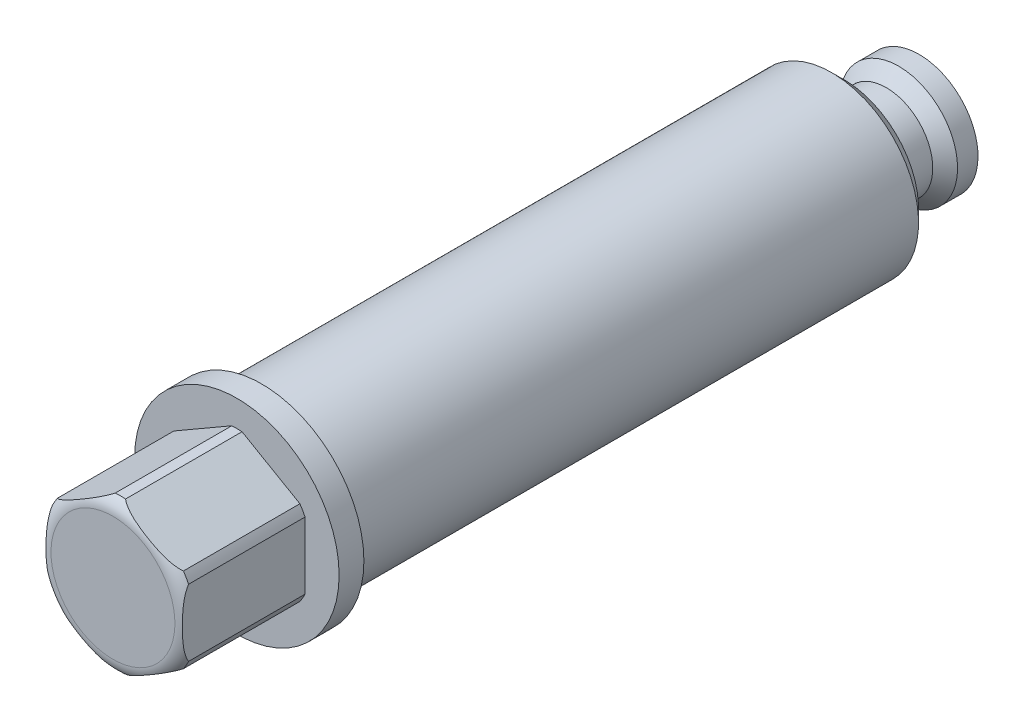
ISO-10303-21;
HEADER;
FILE_DESCRIPTION(('STEP AP214'),'2;1');
FILE_NAME('part.step','',(''),(''),'','','');
FILE_SCHEMA(('AUTOMOTIVE_DESIGN { 1 0 10303 214 1 1 1 1 }'));
ENDSEC;
DATA;
#1=APPLICATION_CONTEXT('core data for automotive mechanical design processes');
#2=APPLICATION_PROTOCOL_DEFINITION('international standard','automotive_design',2000,#1);
#3=PRODUCT_CONTEXT('',#1,'mechanical');
#4=PRODUCT('Part','Part','',(#3));
#5=PRODUCT_RELATED_PRODUCT_CATEGORY('part','',(#4));
#6=PRODUCT_DEFINITION_FORMATION('','',#4);
#7=PRODUCT_DEFINITION_CONTEXT('part definition',#1,'design');
#8=PRODUCT_DEFINITION('design','',#6,#7);
#9=PRODUCT_DEFINITION_SHAPE('','',#8);
#10=(LENGTH_UNIT() NAMED_UNIT(*) SI_UNIT(.MILLI.,.METRE.));
#11=(NAMED_UNIT(*) PLANE_ANGLE_UNIT() SI_UNIT($,.RADIAN.));
#12=(NAMED_UNIT(*) SI_UNIT($,.STERADIAN.) SOLID_ANGLE_UNIT());
#13=UNCERTAINTY_MEASURE_WITH_UNIT(LENGTH_MEASURE(1.E-05),#10,'distance_accuracy_value','');
#14=(GEOMETRIC_REPRESENTATION_CONTEXT(3) GLOBAL_UNCERTAINTY_ASSIGNED_CONTEXT((#13)) GLOBAL_UNIT_ASSIGNED_CONTEXT((#10,
#11,#12)) REPRESENTATION_CONTEXT('',''));
#15=CARTESIAN_POINT('',(0.,0.,0.));
#16=DIRECTION('',(0.,0.,1.));
#17=DIRECTION('',(1.,0.,0.));
#18=AXIS2_PLACEMENT_3D('',#15,#16,#17);
#19=CARTESIAN_POINT('',(0.,-12.7017059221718,113.));
#20=DIRECTION('',(0.5,-0.866025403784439,0.));
#21=DIRECTION('',(0.866025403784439,0.5,0.));
#22=AXIS2_PLACEMENT_3D('',#19,#20,#21);
#23=PLANE('',#22);
#24=CARTESIAN_POINT('',(10.1687123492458,-6.83079711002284,131.793859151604));
#25=CARTESIAN_POINT('',(10.1129325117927,-6.8630016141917,131.836482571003));
#26=CARTESIAN_POINT('',(10.0559059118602,-6.89592593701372,131.876855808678));
#27=CARTESIAN_POINT('',(9.93996765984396,-6.96286291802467,131.953381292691));
#28=CARTESIAN_POINT('',(9.88106158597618,-6.99687235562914,131.989544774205));
#29=CARTESIAN_POINT('',(9.76170288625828,-7.06578413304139,132.05813598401));
#30=CARTESIAN_POINT('',(9.70125131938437,-7.10068586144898,132.090566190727));
#31=CARTESIAN_POINT('',(9.58016618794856,-7.1705943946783,132.151521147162));
#32=CARTESIAN_POINT('',(9.51955479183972,-7.20558840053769,132.180104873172));
#33=CARTESIAN_POINT('',(9.39732105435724,-7.27616008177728,132.234347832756));
#34=CARTESIAN_POINT('',(9.33569812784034,-7.3117380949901,132.260005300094));
#35=CARTESIAN_POINT('',(9.21165950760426,-7.38335182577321,132.30865335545));
#36=CARTESIAN_POINT('',(9.14924366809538,-7.41938762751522,132.331643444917));
#37=CARTESIAN_POINT('',(8.99138382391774,-7.51052805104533,132.386452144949));
#38=CARTESIAN_POINT('',(8.89552952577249,-7.56586955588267,132.416698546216));
#39=CARTESIAN_POINT('',(8.70277268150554,-7.67715777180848,132.472386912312));
#40=CARTESIAN_POINT('',(8.60586989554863,-7.73310462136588,132.497827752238));
#41=CARTESIAN_POINT('',(8.31379127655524,-7.90173629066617,132.568003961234));
#42=CARTESIAN_POINT('',(8.1174903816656,-8.01507066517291,132.606511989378));
#43=CARTESIAN_POINT('',(7.72323299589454,-8.24269527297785,132.671143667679));
#44=CARTESIAN_POINT('',(7.52527491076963,-8.35698642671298,132.697253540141));
#45=CARTESIAN_POINT('',(7.12360101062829,-8.58889296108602,132.740582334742));
#46=CARTESIAN_POINT('',(6.91986619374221,-8.7065193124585,132.757559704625));
#47=CARTESIAN_POINT('',(6.51231016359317,-8.9418218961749,132.783809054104));
#48=CARTESIAN_POINT('',(6.30848940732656,-9.05949786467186,132.793091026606));
#49=CARTESIAN_POINT('',(5.90086638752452,-9.29483912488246,132.805276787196));
#50=CARTESIAN_POINT('',(5.69706422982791,-9.41250435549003,132.808185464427));
#51=CARTESIAN_POINT('',(5.31834568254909,-9.63115761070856,132.80805760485));
#52=CARTESIAN_POINT('',(5.14342867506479,-9.73214599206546,132.805805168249));
#53=CARTESIAN_POINT('',(4.79363062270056,-9.93410199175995,132.796664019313));
#54=CARTESIAN_POINT('',(4.6187496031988,-10.0350695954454,132.789773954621));
#55=CARTESIAN_POINT('',(4.2689614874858,-10.2370198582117,132.770635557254));
#56=CARTESIAN_POINT('',(4.09405468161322,-10.3380023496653,132.758379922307));
#57=CARTESIAN_POINT('',(3.74416838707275,-10.540009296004,132.727259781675));
#58=CARTESIAN_POINT('',(3.5691900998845,-10.6410330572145,132.708376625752));
#59=CARTESIAN_POINT('',(3.22483803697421,-10.8398448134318,132.662887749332));
#60=CARTESIAN_POINT('',(3.05544239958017,-10.9376454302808,132.636508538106));
#61=CARTESIAN_POINT('',(2.71815589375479,-11.132377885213,132.57369473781));
#62=CARTESIAN_POINT('',(2.55026388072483,-11.2293103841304,132.53726861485));
#63=CARTESIAN_POINT('',(2.21755075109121,-11.4214023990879,132.451677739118));
#64=CARTESIAN_POINT('',(2.05272044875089,-11.5165672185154,132.402561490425));
#65=CARTESIAN_POINT('',(1.72770212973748,-11.7042166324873,132.28800126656));
#66=CARTESIAN_POINT('',(1.56750164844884,-11.7967084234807,132.222606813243));
#67=CARTESIAN_POINT('',(1.36101704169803,-11.9159223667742,132.122343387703));
#68=CARTESIAN_POINT('',(1.31126364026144,-11.9446475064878,132.09690891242));
#69=CARTESIAN_POINT('',(1.21270295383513,-12.0015515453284,132.043669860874));
#70=CARTESIAN_POINT('',(1.1638958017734,-12.0297303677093,132.015864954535));
#71=CARTESIAN_POINT('',(1.06692575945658,-12.085716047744,131.957391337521));
#72=CARTESIAN_POINT('',(1.01877501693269,-12.1135158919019,131.926695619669));
#73=CARTESIAN_POINT('',(0.923894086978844,-12.1682954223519,131.862461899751));
#74=CARTESIAN_POINT('',(0.877164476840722,-12.1952747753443,131.828922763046));
#75=CARTESIAN_POINT('',(0.831287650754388,-12.2217617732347,131.793859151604));
#76=B_SPLINE_CURVE_WITH_KNOTS('',3,(#24,#25,#26,#27,#28,#29,#30,#31,#32,#33,#34,#35,#36,#37,#38,
#39,#40,#41,#42,#43,#44,#45,#46,#47,#48,#49,#50,#51,#52,#53,#54,#55,#56,#57,#58,#59,#60,#61,#62,
#63,#64,#65,#66,#67,#68,#69,#70,#71,#72,#73,#74,#75),.UNSPECIFIED.,.F.,.F.,(4,2,2,2,2,2,2,2,2,2,
2,2,2,2,2,2,2,2,2,2,2,2,2,2,2,4),(0.,0.231599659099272,0.462566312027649,0.693378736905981,
0.920104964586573,1.14696732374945,1.3738720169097,1.71795811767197,2.06212466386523,
2.75133882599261,3.44131710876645,4.1487449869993,4.85525278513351,5.56121841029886,
6.16713955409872,6.77323746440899,7.38016282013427,7.98880997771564,8.58072917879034,
9.17215111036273,9.76134512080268,10.3487681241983,10.5372122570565,10.7256826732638,
10.9161322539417,11.1066581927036),.UNSPECIFIED.);
#77=CARTESIAN_POINT('',(10.1687123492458,-6.83079711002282,131.793859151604));
#78=VERTEX_POINT('',#77);
#79=CARTESIAN_POINT('',(0.831287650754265,-12.2217617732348,131.793859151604));
#80=VERTEX_POINT('',#79);
#81=EDGE_CURVE('E172',#78,#80,#76,.T.);
#82=ORIENTED_EDGE('',*,*,#81,.T.);
#83=DIRECTION('',(0.,0.,1.));
#84=VECTOR('',#83,1.);
#85=CARTESIAN_POINT('',(0.831287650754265,-12.2217617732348,113.));
#86=LINE('',#85,#84);
#87=CARTESIAN_POINT('',(0.831287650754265,-12.2217617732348,113.));
#88=VERTEX_POINT('',#87);
#89=EDGE_CURVE('E161',#88,#80,#86,.T.);
#90=ORIENTED_EDGE('',*,*,#89,.F.);
#91=DIRECTION('',(-0.866025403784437,-0.5,0.));
#92=VECTOR('',#91,1.);
#93=CARTESIAN_POINT('',(0.831287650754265,-12.2217617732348,113.));
#94=LINE('',#93,#92);
#95=CARTESIAN_POINT('',(10.1687123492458,-6.83079711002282,113.));
#96=VERTEX_POINT('',#95);
#97=EDGE_CURVE('E658',#96,#88,#94,.T.);
#98=ORIENTED_EDGE('',*,*,#97,.F.);
#99=DIRECTION('',(0.,0.,1.));
#100=VECTOR('',#99,1.);
#101=CARTESIAN_POINT('',(10.1687123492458,-6.83079711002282,113.));
#102=LINE('',#101,#100);
#103=EDGE_CURVE('E163',#96,#78,#102,.T.);
#104=ORIENTED_EDGE('',*,*,#103,.T.);
#105=EDGE_LOOP('',(#82,#90,#98,#104));
#106=FACE_BOUND('',#105,.T.);
#107=ADVANCED_FACE('F20',(#106),#23,.T.);
#108=CARTESIAN_POINT('',(11.,-6.35085296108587,113.));
#109=DIRECTION('',(1.,0.,0.));
#110=DIRECTION('',(0.,1.,0.));
#111=AXIS2_PLACEMENT_3D('',#108,#109,#110);
#112=PLANE('',#111);
#113=CARTESIAN_POINT('',(11.,5.39096466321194,131.793859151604));
#114=CARTESIAN_POINT('',(11.,5.32655565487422,131.836482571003));
#115=CARTESIAN_POINT('',(11.,5.26070700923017,131.876855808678));
#116=CARTESIAN_POINT('',(11.,5.12683304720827,131.953381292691));
#117=CARTESIAN_POINT('',(11.,5.05881417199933,131.989544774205));
#118=CARTESIAN_POINT('',(11.,4.92099061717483,132.05813598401));
#119=CARTESIAN_POINT('',(11.,4.85118716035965,132.090566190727));
#120=CARTESIAN_POINT('',(11.,4.711370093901,132.151521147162));
#121=CARTESIAN_POINT('',(11.,4.64138208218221,132.180104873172));
#122=CARTESIAN_POINT('',(11.,4.50023871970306,132.234347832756));
#123=CARTESIAN_POINT('',(11.,4.42908269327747,132.260005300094));
#124=CARTESIAN_POINT('',(11.,4.28585523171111,132.30865335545));
#125=CARTESIAN_POINT('',(10.9999999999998,4.21378362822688,132.331643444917));
#126=CARTESIAN_POINT('',(10.9999999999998,4.03150278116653,132.386452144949));
#127=CARTESIAN_POINT('',(10.9999999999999,3.92081977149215,132.416698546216));
#128=CARTESIAN_POINT('',(11.0000000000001,3.69824333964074,132.472386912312));
#129=CARTESIAN_POINT('',(11.,3.58634964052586,132.497827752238));
#130=CARTESIAN_POINT('',(11.,3.24908630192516,132.568003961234));
#131=CARTESIAN_POINT('',(11.,3.02241755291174,132.606511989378));
#132=CARTESIAN_POINT('',(11.,2.56716833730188,132.671143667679));
#133=CARTESIAN_POINT('',(11.,2.33858602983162,132.697253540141));
#134=CARTESIAN_POINT('',(11.,1.87477296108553,132.740582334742));
#135=CARTESIAN_POINT('',(11.,1.63952025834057,132.757559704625));
#136=CARTESIAN_POINT('',(11.,1.16891509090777,132.783809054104));
#137=CARTESIAN_POINT('',(11.,0.933563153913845,132.793091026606));
#138=CARTESIAN_POINT('',(11.,0.462880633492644,132.805276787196));
#139=CARTESIAN_POINT('',(11.,0.227550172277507,132.808185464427));
#140=CARTESIAN_POINT('',(11.,-0.209756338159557,132.80805760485));
#141=CARTESIAN_POINT('',(11.,-0.411733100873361,132.805805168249));
#142=CARTESIAN_POINT('',(11.,-0.815645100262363,132.796664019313));
#143=CARTESIAN_POINT('',(11.,-1.01758030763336,132.789773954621));
#144=CARTESIAN_POINT('',(11.,-1.42148083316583,132.770635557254));
#145=CARTESIAN_POINT('',(11.,-1.6234458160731,132.758379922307));
#146=CARTESIAN_POINT('',(11.,-2.02745970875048,132.727259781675));
#147=CARTESIAN_POINT('',(11.,-2.22950723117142,132.708376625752));
#148=CARTESIAN_POINT('',(11.,-2.62713074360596,132.662887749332));
#149=CARTESIAN_POINT('',(11.0000000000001,-2.82273197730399,132.636508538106));
#150=CARTESIAN_POINT('',(10.9999999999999,-3.21219688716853,132.57369473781));
#151=CARTESIAN_POINT('',(10.9999999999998,-3.4060618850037,132.53726861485));
#152=CARTESIAN_POINT('',(11.0000000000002,-3.79024591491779,132.451677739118));
#153=CARTESIAN_POINT('',(11.0000000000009,-3.98057555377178,132.402561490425));
#154=CARTESIAN_POINT('',(10.9999999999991,-4.3558743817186,132.28800126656));
#155=CARTESIAN_POINT('',(10.9999999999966,-4.54085796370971,132.222606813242));
#156=CARTESIAN_POINT('',(10.9999999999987,-4.7792858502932,132.122343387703));
#157=CARTESIAN_POINT('',(10.9999999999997,-4.83673612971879,132.09690891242));
#158=CARTESIAN_POINT('',(11.0000000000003,-4.95054420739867,132.043669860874));
#159=CARTESIAN_POINT('',(11.0000000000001,-5.00690185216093,132.015864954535));
#160=CARTESIAN_POINT('',(10.9999999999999,-5.11887321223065,131.957391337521));
#161=CARTESIAN_POINT('',(10.9999999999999,-5.17447290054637,131.926695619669));
#162=CARTESIAN_POINT('',(11.,-5.28403196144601,131.862461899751));
#163=CARTESIAN_POINT('',(11.0000000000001,-5.33799066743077,131.828922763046));
#164=CARTESIAN_POINT('',(11.,-5.39096466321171,131.793859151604));
#165=B_SPLINE_CURVE_WITH_KNOTS('',3,(#113,#114,#115,#116,#117,#118,#119,#120,#121,#122,#123,
#124,#125,#126,#127,#128,#129,#130,#131,#132,#133,#134,#135,#136,#137,#138,#139,#140,#141,#142,
#143,#144,#145,#146,#147,#148,#149,#150,#151,#152,#153,#154,#155,#156,#157,#158,#159,#160,#161,
#162,#163,#164),.UNSPECIFIED.,.F.,.F.,(4,2,2,2,2,2,2,2,2,2,2,2,2,2,2,2,2,2,2,2,2,2,2,2,2,4),(0.,
0.231599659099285,0.462566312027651,0.693378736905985,0.92010496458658,1.14696732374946,
1.37387201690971,1.71795811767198,2.06212466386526,2.75133882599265,3.44131710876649,
4.14874498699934,4.85525278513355,5.56121841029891,6.16713955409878,6.77323746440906,
7.38016282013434,7.98880997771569,8.5807291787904,9.17215111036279,9.76134512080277,
10.3487681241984,10.5372122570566,10.7256826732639,10.9161322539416,11.1066581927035),.UNSPECIFIED.);
#166=CARTESIAN_POINT('',(11.,5.39096466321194,131.793859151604));
#167=VERTEX_POINT('',#166);
#168=CARTESIAN_POINT('',(11.,-5.39096466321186,131.793859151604));
#169=VERTEX_POINT('',#168);
#170=EDGE_CURVE('E226',#167,#169,#165,.T.);
#171=ORIENTED_EDGE('',*,*,#170,.T.);
#172=DIRECTION('',(0.,0.,1.));
#173=VECTOR('',#172,1.);
#174=CARTESIAN_POINT('',(11.,-5.39096466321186,113.));
#175=LINE('',#174,#173);
#176=CARTESIAN_POINT('',(11.,-5.39096466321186,113.));
#177=VERTEX_POINT('',#176);
#178=EDGE_CURVE('E166',#177,#169,#175,.T.);
#179=ORIENTED_EDGE('',*,*,#178,.F.);
#180=DIRECTION('',(0.,-1.,0.));
#181=VECTOR('',#180,1.);
#182=CARTESIAN_POINT('',(11.,-5.39096466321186,113.));
#183=LINE('',#182,#181);
#184=CARTESIAN_POINT('',(11.,5.39096466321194,113.));
#185=VERTEX_POINT('',#184);
#186=EDGE_CURVE('E123',#185,#177,#183,.T.);
#187=ORIENTED_EDGE('',*,*,#186,.F.);
#188=DIRECTION('',(0.,0.,1.));
#189=VECTOR('',#188,1.);
#190=CARTESIAN_POINT('',(11.,5.39096466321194,113.));
#191=LINE('',#190,#189);
#192=EDGE_CURVE('E119',#185,#167,#191,.T.);
#193=ORIENTED_EDGE('',*,*,#192,.T.);
#194=EDGE_LOOP('',(#171,#179,#187,#193));
#195=FACE_BOUND('',#194,.T.);
#196=ADVANCED_FACE('F355',(#195),#112,.T.);
#197=CARTESIAN_POINT('',(11.,6.35085296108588,113.));
#198=DIRECTION('',(0.5,0.866025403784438,0.));
#199=DIRECTION('',(-0.866025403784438,0.5,0.));
#200=AXIS2_PLACEMENT_3D('',#197,#198,#199);
#201=PLANE('',#200);
#202=CARTESIAN_POINT('',(0.831287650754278,12.2217617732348,131.793859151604));
#203=CARTESIAN_POINT('',(0.887067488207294,12.1895572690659,131.836482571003));
#204=CARTESIAN_POINT('',(0.94409408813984,12.1566329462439,131.876855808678));
#205=CARTESIAN_POINT('',(1.06003234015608,12.0896959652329,131.953381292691));
#206=CARTESIAN_POINT('',(1.11893841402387,12.0556865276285,131.989544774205));
#207=CARTESIAN_POINT('',(1.23829711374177,11.9867747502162,132.05813598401));
#208=CARTESIAN_POINT('',(1.29874868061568,11.9518730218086,132.090566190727));
#209=CARTESIAN_POINT('',(1.41983381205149,11.8819644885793,132.151521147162));
#210=CARTESIAN_POINT('',(1.48044520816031,11.8469704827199,132.180104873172));
#211=CARTESIAN_POINT('',(1.60267894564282,11.7763988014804,132.234347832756));
#212=CARTESIAN_POINT('',(1.66430187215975,11.7408207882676,132.260005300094));
#213=CARTESIAN_POINT('',(1.78834049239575,11.6692070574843,132.30865335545));
#214=CARTESIAN_POINT('',(1.85075633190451,11.6331712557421,132.331643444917));
#215=CARTESIAN_POINT('',(2.00861617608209,11.5420308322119,132.386452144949));
#216=CARTESIAN_POINT('',(2.1044704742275,11.4866893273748,132.416698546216));
#217=CARTESIAN_POINT('',(2.29722731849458,11.3754011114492,132.472386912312));
#218=CARTESIAN_POINT('',(2.39413010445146,11.3194542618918,132.497827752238));
#219=CARTESIAN_POINT('',(2.6862087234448,11.1508225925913,132.568003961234));
#220=CARTESIAN_POINT('',(2.88250961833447,11.0374882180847,132.606511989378));
#221=CARTESIAN_POINT('',(3.27676700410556,10.8098636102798,132.671143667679));
#222=CARTESIAN_POINT('',(3.47472508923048,10.6955724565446,132.697253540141));
#223=CARTESIAN_POINT('',(3.87639898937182,10.4636659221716,132.740582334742));
#224=CARTESIAN_POINT('',(4.0801338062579,10.3460395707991,132.757559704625));
#225=CARTESIAN_POINT('',(4.48768983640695,10.1107369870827,132.783809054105));
#226=CARTESIAN_POINT('',(4.69151059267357,9.9930610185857,132.793091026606));
#227=CARTESIAN_POINT('',(5.09913361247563,9.7577197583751,132.805276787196));
#228=CARTESIAN_POINT('',(5.30293577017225,9.64005452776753,132.808185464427));
#229=CARTESIAN_POINT('',(5.68165431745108,9.42140127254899,132.80805760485));
#230=CARTESIAN_POINT('',(5.85657132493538,9.32041289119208,132.805805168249));
#231=CARTESIAN_POINT('',(6.20636937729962,9.11845689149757,132.796664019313));
#232=CARTESIAN_POINT('',(6.38125039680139,9.01748928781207,132.789773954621));
#233=CARTESIAN_POINT('',(6.73103851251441,8.81553902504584,132.770635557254));
#234=CARTESIAN_POINT('',(6.90594531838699,8.71455653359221,132.758379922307));
#235=CARTESIAN_POINT('',(7.25583161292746,8.5125495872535,132.727259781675));
#236=CARTESIAN_POINT('',(7.43080990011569,8.41152582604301,132.708376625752));
#237=CARTESIAN_POINT('',(7.77516196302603,8.21271406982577,132.662887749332));
#238=CARTESIAN_POINT('',(7.94455760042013,8.11491345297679,132.636508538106));
#239=CARTESIAN_POINT('',(8.28184410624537,7.92018099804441,132.57369473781));
#240=CARTESIAN_POINT('',(8.44973611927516,7.82324849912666,132.53726861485));
#241=CARTESIAN_POINT('',(8.78244924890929,7.63115648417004,132.451677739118));
#242=CARTESIAN_POINT('',(8.94727955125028,7.53599166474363,132.402561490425));
#243=CARTESIAN_POINT('',(9.27229787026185,7.34834225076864,132.28800126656));
#244=CARTESIAN_POINT('',(9.43249835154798,7.25585045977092,132.222606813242));
#245=CARTESIAN_POINT('',(9.63898295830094,7.13663651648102,132.122343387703));
#246=CARTESIAN_POINT('',(9.68873635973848,7.10791137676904,132.09690891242));
#247=CARTESIAN_POINT('',(9.78729704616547,7.0510073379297,132.043669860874));
#248=CARTESIAN_POINT('',(9.83610419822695,7.02282851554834,132.015864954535));
#249=CARTESIAN_POINT('',(9.93307424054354,6.9668428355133,131.957391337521));
#250=CARTESIAN_POINT('',(9.98122498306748,6.93904299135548,131.926695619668));
#251=CARTESIAN_POINT('',(10.0761059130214,6.88426346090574,131.862461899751));
#252=CARTESIAN_POINT('',(10.1228355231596,6.85728410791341,131.828922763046));
#253=CARTESIAN_POINT('',(10.1687123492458,6.83079711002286,131.793859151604));
#254=B_SPLINE_CURVE_WITH_KNOTS('',3,(#202,#203,#204,#205,#206,#207,#208,#209,#210,#211,#212,
#213,#214,#215,#216,#217,#218,#219,#220,#221,#222,#223,#224,#225,#226,#227,#228,#229,#230,#231,
#232,#233,#234,#235,#236,#237,#238,#239,#240,#241,#242,#243,#244,#245,#246,#247,#248,#249,#250,
#251,#252,#253),.UNSPECIFIED.,.F.,.F.,(4,2,2,2,2,2,2,2,2,2,2,2,2,2,2,2,2,2,2,2,2,2,2,2,2,4),(0.,
0.231599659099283,0.462566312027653,0.693378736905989,0.920104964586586,1.14696732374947,
1.37387201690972,1.717958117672,2.06212466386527,2.75133882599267,3.44131710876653,
4.14874498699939,4.85525278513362,5.56121841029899,6.16713955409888,6.77323746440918,
7.38016282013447,7.98880997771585,8.58072917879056,9.17215111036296,9.76134512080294,
10.3487681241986,10.5372122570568,10.7256826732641,10.9161322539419,11.1066581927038),.UNSPECIFIED.);
#255=CARTESIAN_POINT('',(0.83128765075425,12.2217617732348,131.793859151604));
#256=VERTEX_POINT('',#255);
#257=CARTESIAN_POINT('',(10.1687123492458,6.83079711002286,131.793859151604));
#258=VERTEX_POINT('',#257);
#259=EDGE_CURVE('E133',#256,#258,#254,.T.);
#260=ORIENTED_EDGE('',*,*,#259,.T.);
#261=DIRECTION('',(0.,0.,1.));
#262=VECTOR('',#261,1.);
#263=CARTESIAN_POINT('',(10.1687123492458,6.83079711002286,113.));
#264=LINE('',#263,#262);
#265=CARTESIAN_POINT('',(10.1687123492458,6.83079711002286,113.));
#266=VERTEX_POINT('',#265);
#267=EDGE_CURVE('E117',#266,#258,#264,.T.);
#268=ORIENTED_EDGE('',*,*,#267,.F.);
#269=DIRECTION('',(0.866025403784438,-0.5,0.));
#270=VECTOR('',#269,1.);
#271=CARTESIAN_POINT('',(10.1687123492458,6.83079711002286,113.));
#272=LINE('',#271,#270);
#273=CARTESIAN_POINT('',(0.831287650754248,12.2217617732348,113.));
#274=VERTEX_POINT('',#273);
#275=EDGE_CURVE('E130',#274,#266,#272,.T.);
#276=ORIENTED_EDGE('',*,*,#275,.F.);
#277=DIRECTION('',(0.,0.,1.));
#278=VECTOR('',#277,1.);
#279=CARTESIAN_POINT('',(0.831287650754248,12.2217617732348,113.));
#280=LINE('',#279,#278);
#281=EDGE_CURVE('E134',#274,#256,#280,.T.);
#282=ORIENTED_EDGE('',*,*,#281,.T.);
#283=EDGE_LOOP('',(#260,#268,#276,#282));
#284=FACE_BOUND('',#283,.T.);
#285=ADVANCED_FACE('F129',(#284),#201,.T.);
#286=CARTESIAN_POINT('',(0.,12.7017059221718,113.));
#287=DIRECTION('',(-0.5,0.866025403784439,0.));
#288=DIRECTION('',(-0.866025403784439,-0.5,0.));
#289=AXIS2_PLACEMENT_3D('',#286,#287,#288);
#290=PLANE('',#289);
#291=CARTESIAN_POINT('',(-10.1687123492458,6.83079711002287,131.793859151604));
#292=CARTESIAN_POINT('',(-10.1129325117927,6.86300161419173,131.836482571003));
#293=CARTESIAN_POINT('',(-10.0559059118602,6.89592593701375,131.876855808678));
#294=CARTESIAN_POINT('',(-9.93996765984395,6.9628629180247,131.953381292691));
#295=CARTESIAN_POINT('',(-9.88106158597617,6.99687235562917,131.989544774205));
#296=CARTESIAN_POINT('',(-9.76170288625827,7.06578413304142,132.05813598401));
#297=CARTESIAN_POINT('',(-9.70125131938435,7.10068586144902,132.090566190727));
#298=CARTESIAN_POINT('',(-9.58016618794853,7.17059439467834,132.151521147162));
#299=CARTESIAN_POINT('',(-9.5195547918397,7.20558840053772,132.180104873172));
#300=CARTESIAN_POINT('',(-9.39732105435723,7.27616008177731,132.234347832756));
#301=CARTESIAN_POINT('',(-9.33569812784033,7.31173809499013,132.260005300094));
#302=CARTESIAN_POINT('',(-9.21165950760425,7.38335182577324,132.30865335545));
#303=CARTESIAN_POINT('',(-9.14924366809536,7.41938762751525,132.331643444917));
#304=CARTESIAN_POINT('',(-8.99138382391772,7.51052805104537,132.386452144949));
#305=CARTESIAN_POINT('',(-8.89552952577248,7.5658695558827,132.416698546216));
#306=CARTESIAN_POINT('',(-8.70277268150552,7.67715777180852,132.472386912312));
#307=CARTESIAN_POINT('',(-8.6058698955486,7.73310462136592,132.497827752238));
#308=CARTESIAN_POINT('',(-8.3137912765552,7.90173629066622,132.568003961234));
#309=CARTESIAN_POINT('',(-8.11749038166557,8.01507066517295,132.606511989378));
#310=CARTESIAN_POINT('',(-7.72323299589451,8.2426952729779,132.671143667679));
#311=CARTESIAN_POINT('',(-7.52527491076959,8.35698642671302,132.697253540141));
#312=CARTESIAN_POINT('',(-7.12360101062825,8.58889296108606,132.740582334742));
#313=CARTESIAN_POINT('',(-6.91986619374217,8.70651931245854,132.757559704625));
#314=CARTESIAN_POINT('',(-6.51231016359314,8.94182189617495,132.783809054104));
#315=CARTESIAN_POINT('',(-6.30848940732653,9.05949786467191,132.793091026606));
#316=CARTESIAN_POINT('',(-5.90086638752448,9.2948391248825,132.805276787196));
#317=CARTESIAN_POINT('',(-5.69706422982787,9.41250435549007,132.808185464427));
#318=CARTESIAN_POINT('',(-5.31834568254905,9.6311576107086,132.80805760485));
#319=CARTESIAN_POINT('',(-5.14342867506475,9.7321459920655,132.805805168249));
#320=CARTESIAN_POINT('',(-4.79363062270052,9.93410199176,132.796664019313));
#321=CARTESIAN_POINT('',(-4.61874960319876,10.0350695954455,132.789773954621));
#322=CARTESIAN_POINT('',(-4.26896148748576,10.2370198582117,132.770635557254));
#323=CARTESIAN_POINT('',(-4.09405468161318,10.3380023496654,132.758379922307));
#324=CARTESIAN_POINT('',(-3.74416838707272,10.5400092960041,132.727259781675));
#325=CARTESIAN_POINT('',(-3.56919009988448,10.6410330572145,132.708376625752));
#326=CARTESIAN_POINT('',(-3.22483803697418,10.8398448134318,132.662887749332));
#327=CARTESIAN_POINT('',(-3.05544239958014,10.9376454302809,132.636508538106));
#328=CARTESIAN_POINT('',(-2.71815589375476,11.132377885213,132.57369473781));
#329=CARTESIAN_POINT('',(-2.5502638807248,11.2293103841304,132.53726861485));
#330=CARTESIAN_POINT('',(-2.21755075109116,11.4214023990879,132.451677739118));
#331=CARTESIAN_POINT('',(-2.05272044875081,11.5165672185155,132.402561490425));
#332=CARTESIAN_POINT('',(-1.72770212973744,11.7042166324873,132.28800126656));
#333=CARTESIAN_POINT('',(-1.56750164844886,11.7967084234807,132.222606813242));
#334=CARTESIAN_POINT('',(-1.36101704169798,11.9159223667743,132.122343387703));
#335=CARTESIAN_POINT('',(-1.31126364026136,11.9446475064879,132.09690891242));
#336=CARTESIAN_POINT('',(-1.21270295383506,12.0015515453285,132.043669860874));
#337=CARTESIAN_POINT('',(-1.16389580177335,12.0297303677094,132.015864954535));
#338=CARTESIAN_POINT('',(-1.06692575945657,12.0857160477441,131.957391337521));
#339=CARTESIAN_POINT('',(-1.01877501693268,12.113515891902,131.926695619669));
#340=CARTESIAN_POINT('',(-0.923894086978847,12.1682954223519,131.862461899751));
#341=CARTESIAN_POINT('',(-0.87716447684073,12.1952747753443,131.828922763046));
#342=CARTESIAN_POINT('',(-0.831287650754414,12.2217617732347,131.793859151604));
#343=B_SPLINE_CURVE_WITH_KNOTS('',3,(#291,#292,#293,#294,#295,#296,#297,#298,#299,#300,#301,
#302,#303,#304,#305,#306,#307,#308,#309,#310,#311,#312,#313,#314,#315,#316,#317,#318,#319,#320,
#321,#322,#323,#324,#325,#326,#327,#328,#329,#330,#331,#332,#333,#334,#335,#336,#337,#338,#339,
#340,#341,#342),.UNSPECIFIED.,.F.,.F.,(4,2,2,2,2,2,2,2,2,2,2,2,2,2,2,2,2,2,2,2,2,2,2,2,2,4),(0.,
0.231599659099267,0.462566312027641,0.693378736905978,0.920104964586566,1.14696732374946,
1.3738720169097,1.71795811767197,2.06212466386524,2.75133882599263,3.44131710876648,
4.14874498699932,4.85525278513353,5.56121841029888,6.16713955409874,6.77323746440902,
7.38016282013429,7.98880997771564,8.58072917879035,9.17215111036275,9.76134512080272,
10.3487681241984,10.5372122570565,10.7256826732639,10.9161322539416,11.1066581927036),.UNSPECIFIED.);
#344=CARTESIAN_POINT('',(-10.1687123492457,6.83079711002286,131.793859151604));
#345=VERTEX_POINT('',#344);
#346=CARTESIAN_POINT('',(-0.831287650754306,12.2217617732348,131.793859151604));
#347=VERTEX_POINT('',#346);
#348=EDGE_CURVE('E329',#345,#347,#343,.T.);
#349=ORIENTED_EDGE('',*,*,#348,.T.);
#350=DIRECTION('',(0.,0.,1.));
#351=VECTOR('',#350,1.);
#352=CARTESIAN_POINT('',(-0.831287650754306,12.2217617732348,113.));
#353=LINE('',#352,#351);
#354=CARTESIAN_POINT('',(-0.831287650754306,12.2217617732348,113.));
#355=VERTEX_POINT('',#354);
#356=EDGE_CURVE('E146',#355,#347,#353,.T.);
#357=ORIENTED_EDGE('',*,*,#356,.F.);
#358=DIRECTION('',(0.866025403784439,0.5,0.));
#359=VECTOR('',#358,1.);
#360=CARTESIAN_POINT('',(-0.831287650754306,12.2217617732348,113.));
#361=LINE('',#360,#359);
#362=CARTESIAN_POINT('',(-10.1687123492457,6.83079711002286,113.));
#363=VERTEX_POINT('',#362);
#364=EDGE_CURVE('E141',#363,#355,#361,.T.);
#365=ORIENTED_EDGE('',*,*,#364,.F.);
#366=DIRECTION('',(0.,0.,1.));
#367=VECTOR('',#366,1.);
#368=CARTESIAN_POINT('',(-10.1687123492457,6.83079711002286,113.));
#369=LINE('',#368,#367);
#370=EDGE_CURVE('E148',#363,#345,#369,.T.);
#371=ORIENTED_EDGE('',*,*,#370,.T.);
#372=EDGE_LOOP('',(#349,#357,#365,#371));
#373=FACE_BOUND('',#372,.T.);
#374=ADVANCED_FACE('F347',(#373),#290,.T.);
#375=CARTESIAN_POINT('',(-11.,6.3508529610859,113.));
#376=DIRECTION('',(-1.,0.,0.));
#377=DIRECTION('',(0.,-1.,0.));
#378=AXIS2_PLACEMENT_3D('',#375,#376,#377);
#379=PLANE('',#378);
#380=CARTESIAN_POINT('',(-11.,-5.39096466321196,131.793859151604));
#381=CARTESIAN_POINT('',(-11.,-5.32655565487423,131.836482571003));
#382=CARTESIAN_POINT('',(-11.,-5.26070700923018,131.876855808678));
#383=CARTESIAN_POINT('',(-11.,-5.12683304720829,131.953381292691));
#384=CARTESIAN_POINT('',(-11.,-5.05881417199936,131.989544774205));
#385=CARTESIAN_POINT('',(-11.,-4.92099061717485,132.05813598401));
#386=CARTESIAN_POINT('',(-11.,-4.85118716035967,132.090566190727));
#387=CARTESIAN_POINT('',(-11.,-4.71137009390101,132.151521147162));
#388=CARTESIAN_POINT('',(-11.,-4.64138208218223,132.180104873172));
#389=CARTESIAN_POINT('',(-11.,-4.50023871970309,132.234347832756));
#390=CARTESIAN_POINT('',(-11.,-4.4290826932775,132.260005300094));
#391=CARTESIAN_POINT('',(-11.,-4.28585523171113,132.30865335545));
#392=CARTESIAN_POINT('',(-10.9999999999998,-4.2137836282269,132.331643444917));
#393=CARTESIAN_POINT('',(-10.9999999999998,-4.03150278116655,132.386452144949));
#394=CARTESIAN_POINT('',(-10.9999999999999,-3.92081977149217,132.416698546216));
#395=CARTESIAN_POINT('',(-11.0000000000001,-3.69824333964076,132.472386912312));
#396=CARTESIAN_POINT('',(-11.,-3.58634964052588,132.497827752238));
#397=CARTESIAN_POINT('',(-11.,-3.24908630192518,132.568003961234));
#398=CARTESIAN_POINT('',(-11.,-3.02241755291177,132.606511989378));
#399=CARTESIAN_POINT('',(-11.,-2.56716833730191,132.671143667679));
#400=CARTESIAN_POINT('',(-11.,-2.33858602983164,132.697253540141));
#401=CARTESIAN_POINT('',(-11.,-1.87477296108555,132.740582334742));
#402=CARTESIAN_POINT('',(-11.,-1.63952025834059,132.757559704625));
#403=CARTESIAN_POINT('',(-11.,-1.16891509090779,132.783809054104));
#404=CARTESIAN_POINT('',(-11.,-0.933563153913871,132.793091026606));
#405=CARTESIAN_POINT('',(-11.,-0.462880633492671,132.805276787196));
#406=CARTESIAN_POINT('',(-11.,-0.227550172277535,132.808185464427));
#407=CARTESIAN_POINT('',(-11.,0.209756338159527,132.80805760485));
#408=CARTESIAN_POINT('',(-11.,0.41173310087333,132.805805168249));
#409=CARTESIAN_POINT('',(-11.,0.81564510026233,132.796664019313));
#410=CARTESIAN_POINT('',(-11.,1.01758030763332,132.789773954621));
#411=CARTESIAN_POINT('',(-11.,1.42148083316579,132.770635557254));
#412=CARTESIAN_POINT('',(-11.,1.62344581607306,132.758379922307));
#413=CARTESIAN_POINT('',(-11.,2.02745970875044,132.727259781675));
#414=CARTESIAN_POINT('',(-11.,2.22950723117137,132.708376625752));
#415=CARTESIAN_POINT('',(-11.,2.62713074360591,132.662887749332));
#416=CARTESIAN_POINT('',(-11.0000000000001,2.82273197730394,132.636508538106));
#417=CARTESIAN_POINT('',(-10.9999999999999,3.21219688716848,132.57369473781));
#418=CARTESIAN_POINT('',(-10.9999999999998,3.40606188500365,132.53726861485));
#419=CARTESIAN_POINT('',(-11.0000000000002,3.79024591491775,132.451677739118));
#420=CARTESIAN_POINT('',(-11.0000000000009,3.98057555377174,132.402561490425));
#421=CARTESIAN_POINT('',(-10.9999999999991,4.35587438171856,132.28800126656));
#422=CARTESIAN_POINT('',(-10.9999999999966,4.54085796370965,132.222606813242));
#423=CARTESIAN_POINT('',(-10.9999999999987,4.77928585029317,132.122343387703));
#424=CARTESIAN_POINT('',(-10.9999999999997,4.83673612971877,132.09690891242));
#425=CARTESIAN_POINT('',(-11.0000000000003,4.95054420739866,132.043669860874));
#426=CARTESIAN_POINT('',(-11.0000000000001,5.00690185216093,132.015864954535));
#427=CARTESIAN_POINT('',(-10.9999999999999,5.11887321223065,131.957391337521));
#428=CARTESIAN_POINT('',(-10.9999999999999,5.17447290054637,131.926695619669));
#429=CARTESIAN_POINT('',(-11.,5.28403196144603,131.862461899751));
#430=CARTESIAN_POINT('',(-11.0000000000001,5.33799066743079,131.828922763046));
#431=CARTESIAN_POINT('',(-11.,5.39096466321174,131.793859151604));
#432=B_SPLINE_CURVE_WITH_KNOTS('',3,(#380,#381,#382,#383,#384,#385,#386,#387,#388,#389,#390,
#391,#392,#393,#394,#395,#396,#397,#398,#399,#400,#401,#402,#403,#404,#405,#406,#407,#408,#409,
#410,#411,#412,#413,#414,#415,#416,#417,#418,#419,#420,#421,#422,#423,#424,#425,#426,#427,#428,
#429,#430,#431),.UNSPECIFIED.,.F.,.F.,(4,2,2,2,2,2,2,2,2,2,2,2,2,2,2,2,2,2,2,2,2,2,2,2,2,4),(0.,
0.231599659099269,0.462566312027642,0.693378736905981,0.920104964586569,1.14696732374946,
1.3738720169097,1.71795811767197,2.06212466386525,2.75133882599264,3.44131710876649,
4.14874498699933,4.85525278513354,5.56121841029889,6.16713955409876,6.77323746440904,
7.38016282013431,7.98880997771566,8.58072917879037,9.17215111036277,9.76134512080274,
10.3487681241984,10.5372122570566,10.7256826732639,10.9161322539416,11.1066581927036),.UNSPECIFIED.);
#433=CARTESIAN_POINT('',(-11.,-5.39096466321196,131.793859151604));
#434=VERTEX_POINT('',#433);
#435=CARTESIAN_POINT('',(-11.,5.39096466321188,131.793859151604));
#436=VERTEX_POINT('',#435);
#437=EDGE_CURVE('E194',#434,#436,#432,.T.);
#438=ORIENTED_EDGE('',*,*,#437,.T.);
#439=DIRECTION('',(0.,0.,1.));
#440=VECTOR('',#439,1.);
#441=CARTESIAN_POINT('',(-11.,5.39096466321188,113.));
#442=LINE('',#441,#440);
#443=CARTESIAN_POINT('',(-11.,5.39096466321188,113.));
#444=VERTEX_POINT('',#443);
#445=EDGE_CURVE('E151',#444,#436,#442,.T.);
#446=ORIENTED_EDGE('',*,*,#445,.F.);
#447=DIRECTION('',(0.,1.,0.));
#448=VECTOR('',#447,1.);
#449=CARTESIAN_POINT('',(-11.,5.39096466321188,113.));
#450=LINE('',#449,#448);
#451=CARTESIAN_POINT('',(-11.,-5.39096466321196,113.));
#452=VERTEX_POINT('',#451);
#453=EDGE_CURVE('E670',#452,#444,#450,.T.);
#454=ORIENTED_EDGE('',*,*,#453,.F.);
#455=DIRECTION('',(0.,0.,1.));
#456=VECTOR('',#455,1.);
#457=CARTESIAN_POINT('',(-11.,-5.39096466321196,113.));
#458=LINE('',#457,#456);
#459=EDGE_CURVE('E153',#452,#434,#458,.T.);
#460=ORIENTED_EDGE('',*,*,#459,.T.);
#461=EDGE_LOOP('',(#438,#446,#454,#460));
#462=FACE_BOUND('',#461,.T.);
#463=ADVANCED_FACE('F350',(#462),#379,.T.);
#464=CARTESIAN_POINT('',(-11.,-6.35085296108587,113.));
#465=DIRECTION('',(-0.5,-0.866025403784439,0.));
#466=DIRECTION('',(0.,0.,-1.));
#467=AXIS2_PLACEMENT_3D('',#464,#465,#466);
#468=PLANE('',#467);
#469=CARTESIAN_POINT('',(-0.83128765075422,-12.2217617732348,131.793859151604));
#470=CARTESIAN_POINT('',(-0.887067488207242,-12.1895572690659,131.836482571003));
#471=CARTESIAN_POINT('',(-0.944094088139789,-12.1566329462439,131.876855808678));
#472=CARTESIAN_POINT('',(-1.06003234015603,-12.089695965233,131.953381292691));
#473=CARTESIAN_POINT('',(-1.11893841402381,-12.0556865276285,131.989544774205));
#474=CARTESIAN_POINT('',(-1.23829711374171,-11.9867747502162,132.05813598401));
#475=CARTESIAN_POINT('',(-1.29874868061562,-11.9518730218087,132.090566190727));
#476=CARTESIAN_POINT('',(-1.41983381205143,-11.8819644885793,132.151521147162));
#477=CARTESIAN_POINT('',(-1.48044520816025,-11.8469704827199,132.180104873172));
#478=CARTESIAN_POINT('',(-1.60267894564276,-11.7763988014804,132.234347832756));
#479=CARTESIAN_POINT('',(-1.6643018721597,-11.7408207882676,132.260005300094));
#480=CARTESIAN_POINT('',(-1.78834049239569,-11.6692070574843,132.30865335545));
#481=CARTESIAN_POINT('',(-1.85075633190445,-11.6331712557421,132.331643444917));
#482=CARTESIAN_POINT('',(-2.00861617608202,-11.5420308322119,132.386452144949));
#483=CARTESIAN_POINT('',(-2.10447047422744,-11.4866893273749,132.416698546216));
#484=CARTESIAN_POINT('',(-2.29722731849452,-11.3754011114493,132.472386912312));
#485=CARTESIAN_POINT('',(-2.39413010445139,-11.3194542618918,132.497827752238));
#486=CARTESIAN_POINT('',(-2.68620872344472,-11.1508225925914,132.568003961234));
#487=CARTESIAN_POINT('',(-2.88250961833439,-11.0374882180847,132.606511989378));
#488=CARTESIAN_POINT('',(-3.27676700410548,-10.8098636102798,132.671143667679));
#489=CARTESIAN_POINT('',(-3.47472508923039,-10.6955724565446,132.697253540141));
#490=CARTESIAN_POINT('',(-3.87639898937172,-10.4636659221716,132.740582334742));
#491=CARTESIAN_POINT('',(-4.0801338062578,-10.3460395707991,132.757559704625));
#492=CARTESIAN_POINT('',(-4.48768983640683,-10.1107369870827,132.783809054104));
#493=CARTESIAN_POINT('',(-4.69151059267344,-9.99306101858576,132.793091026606));
#494=CARTESIAN_POINT('',(-5.09913361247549,-9.75771975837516,132.805276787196));
#495=CARTESIAN_POINT('',(-5.3029357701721,-9.6400545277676,132.808185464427));
#496=CARTESIAN_POINT('',(-5.68165431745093,-9.42140127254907,132.80805760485));
#497=CARTESIAN_POINT('',(-5.85657132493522,-9.32041289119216,132.805805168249));
#498=CARTESIAN_POINT('',(-6.20636937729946,-9.11845689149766,132.796664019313));
#499=CARTESIAN_POINT('',(-6.38125039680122,-9.01748928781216,132.789773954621));
#500=CARTESIAN_POINT('',(-6.73103851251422,-8.81553902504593,132.770635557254));
#501=CARTESIAN_POINT('',(-6.90594531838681,-8.7145565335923,132.758379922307));
#502=CARTESIAN_POINT('',(-7.25583161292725,-8.5125495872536,132.727259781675));
#503=CARTESIAN_POINT('',(-7.43080990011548,-8.41152582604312,132.708376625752));
#504=CARTESIAN_POINT('',(-7.77516196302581,-8.21271406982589,132.662887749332));
#505=CARTESIAN_POINT('',(-7.9445576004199,-8.11491345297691,132.636508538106));
#506=CARTESIAN_POINT('',(-8.28184410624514,-7.92018099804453,132.57369473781));
#507=CARTESIAN_POINT('',(-8.44973611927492,-7.82324849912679,132.53726861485));
#508=CARTESIAN_POINT('',(-8.78244924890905,-7.63115648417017,132.451677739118));
#509=CARTESIAN_POINT('',(-8.94727955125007,-7.53599166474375,132.402561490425));
#510=CARTESIAN_POINT('',(-9.27229787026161,-7.34834225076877,132.28800126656));
#511=CARTESIAN_POINT('',(-9.43249835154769,-7.25585045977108,132.222606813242));
#512=CARTESIAN_POINT('',(-9.63898295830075,-7.13663651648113,132.122343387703));
#513=CARTESIAN_POINT('',(-9.68873635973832,-7.10791137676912,132.09690891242));
#514=CARTESIAN_POINT('',(-9.78729704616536,-7.05100733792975,132.043669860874));
#515=CARTESIAN_POINT('',(-9.83610419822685,-7.02282851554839,132.015864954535));
#516=CARTESIAN_POINT('',(-9.93307424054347,-6.96684283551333,131.957391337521));
#517=CARTESIAN_POINT('',(-9.98122498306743,-6.9390429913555,131.926695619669));
#518=CARTESIAN_POINT('',(-10.0761059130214,-6.88426346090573,131.862461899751));
#519=CARTESIAN_POINT('',(-10.1228355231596,-6.85728410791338,131.828922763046));
#520=CARTESIAN_POINT('',(-10.1687123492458,-6.83079711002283,131.793859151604));
#521=B_SPLINE_CURVE_WITH_KNOTS('',3,(#469,#470,#471,#472,#473,#474,#475,#476,#477,#478,#479,
#480,#481,#482,#483,#484,#485,#486,#487,#488,#489,#490,#491,#492,#493,#494,#495,#496,#497,#498,
#499,#500,#501,#502,#503,#504,#505,#506,#507,#508,#509,#510,#511,#512,#513,#514,#515,#516,#517,
#518,#519,#520),.UNSPECIFIED.,.F.,.F.,(4,2,2,2,2,2,2,2,2,2,2,2,2,2,2,2,2,2,2,2,2,2,2,2,2,4),(0.,
0.231599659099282,0.462566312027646,0.693378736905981,0.920104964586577,1.14696732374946,
1.3738720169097,1.71795811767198,2.06212466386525,2.75133882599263,3.44131710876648,
4.14874498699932,4.85525278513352,5.56121841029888,6.16713955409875,6.77323746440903,
7.3801628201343,7.98880997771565,8.58072917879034,9.17215111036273,9.76134512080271,
10.3487681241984,10.5372122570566,10.725682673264,10.9161322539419,11.1066581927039),.UNSPECIFIED.);
#522=CARTESIAN_POINT('',(-0.831287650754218,-12.2217617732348,131.793859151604));
#523=VERTEX_POINT('',#522);
#524=CARTESIAN_POINT('',(-10.1687123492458,-6.83079711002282,131.793859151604));
#525=VERTEX_POINT('',#524);
#526=EDGE_CURVE('E210',#523,#525,#521,.T.);
#527=ORIENTED_EDGE('',*,*,#526,.T.);
#528=DIRECTION('',(0.,0.,1.));
#529=VECTOR('',#528,1.);
#530=CARTESIAN_POINT('',(-10.1687123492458,-6.83079711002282,113.));
#531=LINE('',#530,#529);
#532=CARTESIAN_POINT('',(-10.1687123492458,-6.83079711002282,113.));
#533=VERTEX_POINT('',#532);
#534=EDGE_CURVE('E156',#533,#525,#531,.T.);
#535=ORIENTED_EDGE('',*,*,#534,.F.);
#536=DIRECTION('',(-0.866025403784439,0.5,0.));
#537=VECTOR('',#536,1.);
#538=CARTESIAN_POINT('',(-10.1687123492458,-6.83079711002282,113.));
#539=LINE('',#538,#537);
#540=CARTESIAN_POINT('',(-0.831287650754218,-12.2217617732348,113.));
#541=VERTEX_POINT('',#540);
#542=EDGE_CURVE('E664',#541,#533,#539,.T.);
#543=ORIENTED_EDGE('',*,*,#542,.F.);
#544=DIRECTION('',(0.,0.,1.));
#545=VECTOR('',#544,1.);
#546=CARTESIAN_POINT('',(-0.831287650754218,-12.2217617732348,113.));
#547=LINE('',#546,#545);
#548=EDGE_CURVE('E158',#541,#523,#547,.T.);
#549=ORIENTED_EDGE('',*,*,#548,.T.);
#550=EDGE_LOOP('',(#527,#535,#543,#549));
#551=FACE_BOUND('',#550,.T.);
#552=ADVANCED_FACE('F186',(#551),#468,.T.);
#553=CARTESIAN_POINT('',(11.,-6.35085296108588,133.));
#554=DIRECTION('',(0.,0.,-1.));
#555=DIRECTION('',(-0.866025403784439,0.5,0.));
#556=AXIS2_PLACEMENT_3D('',#553,#554,#555);
#557=PLANE('',#556);
#558=CARTESIAN_POINT('',(0.,0.,133.));
#559=DIRECTION('',(0.,0.,-1.));
#560=DIRECTION('',(0.866025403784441,-0.499999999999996,0.));
#561=AXIS2_PLACEMENT_3D('',#558,#559,#560);
#562=CIRCLE('',#561,10.);
#563=CARTESIAN_POINT('',(8.66025403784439,-5.,133.));
#564=VERTEX_POINT('',#563);
#565=CARTESIAN_POINT('',(-8.66025403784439,5.,133.));
#566=VERTEX_POINT('',#565);
#567=EDGE_CURVE('E173',#564,#566,#562,.T.);
#568=ORIENTED_EDGE('',*,*,#567,.F.);
#569=CARTESIAN_POINT('',(0.,0.,133.));
#570=DIRECTION('',(0.,0.,-1.));
#571=DIRECTION('',(-0.86602540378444,0.499999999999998,0.));
#572=AXIS2_PLACEMENT_3D('',#569,#570,#571);
#573=CIRCLE('',#572,10.);
#574=EDGE_CURVE('E35',#566,#564,#573,.T.);
#575=ORIENTED_EDGE('',*,*,#574,.F.);
#576=EDGE_LOOP('',(#568,#575));
#577=FACE_BOUND('',#576,.T.);
#578=ADVANCED_FACE('F184',(#577),#557,.F.);
#579=CARTESIAN_POINT('',(0.,0.,130.298294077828));
#580=DIRECTION('',(0.,0.,1.));
#581=DIRECTION('',(0.866025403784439,-0.5,0.));
#582=AXIS2_PLACEMENT_3D('',#579,#580,#581);
#583=TOROIDAL_SURFACE('',#582,10.,2.70170592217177);
#584=ORIENTED_EDGE('',*,*,#348,.F.);
#585=CARTESIAN_POINT('',(0.,0.,131.793859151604));
#586=DIRECTION('',(0.,0.,1.));
#587=DIRECTION('',(0.866025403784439,-0.5,0.));
#588=AXIS2_PLACEMENT_3D('',#585,#586,#587);
#589=CIRCLE('',#588,12.25);
#590=EDGE_CURVE('E262',#345,#436,#589,.T.);
#591=ORIENTED_EDGE('',*,*,#590,.T.);
#592=ORIENTED_EDGE('',*,*,#437,.F.);
#593=CARTESIAN_POINT('',(0.,0.,131.793859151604));
#594=DIRECTION('',(0.,0.,1.));
#595=DIRECTION('',(0.866025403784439,-0.5,0.));
#596=AXIS2_PLACEMENT_3D('',#593,#594,#595);
#597=CIRCLE('',#596,12.25);
#598=EDGE_CURVE('E169',#525,#434,#597,.F.);
#599=ORIENTED_EDGE('',*,*,#598,.F.);
#600=ORIENTED_EDGE('',*,*,#526,.F.);
#601=CARTESIAN_POINT('',(0.,0.,131.793859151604));
#602=DIRECTION('',(0.,0.,1.));
#603=DIRECTION('',(0.866025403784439,-0.5,0.));
#604=AXIS2_PLACEMENT_3D('',#601,#602,#603);
#605=CIRCLE('',#604,12.25);
#606=EDGE_CURVE('E271',#523,#80,#605,.T.);
#607=ORIENTED_EDGE('',*,*,#606,.T.);
#608=ORIENTED_EDGE('',*,*,#81,.F.);
#609=CARTESIAN_POINT('',(0.,0.,131.793859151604));
#610=DIRECTION('',(0.,0.,1.));
#611=DIRECTION('',(0.866025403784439,-0.5,0.));
#612=AXIS2_PLACEMENT_3D('',#609,#610,#611);
#613=CIRCLE('',#612,12.25);
#614=EDGE_CURVE('E176',#78,#169,#613,.T.);
#615=ORIENTED_EDGE('',*,*,#614,.T.);
#616=ORIENTED_EDGE('',*,*,#170,.F.);
#617=CARTESIAN_POINT('',(0.,0.,131.793859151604));
#618=DIRECTION('',(0.,0.,1.));
#619=DIRECTION('',(0.866025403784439,-0.5,0.));
#620=AXIS2_PLACEMENT_3D('',#617,#618,#619);
#621=CIRCLE('',#620,12.25);
#622=EDGE_CURVE('E282',#167,#258,#621,.T.);
#623=ORIENTED_EDGE('',*,*,#622,.T.);
#624=ORIENTED_EDGE('',*,*,#259,.F.);
#625=CARTESIAN_POINT('',(0.,0.,131.793859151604));
#626=DIRECTION('',(0.,0.,1.));
#627=DIRECTION('',(0.866025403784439,-0.5,0.));
#628=AXIS2_PLACEMENT_3D('',#625,#626,#627);
#629=CIRCLE('',#628,12.25);
#630=EDGE_CURVE('E263',#347,#256,#629,.F.);
#631=ORIENTED_EDGE('',*,*,#630,.F.);
#632=EDGE_LOOP('',(#584,#591,#592,#599,#600,#607,#608,#615,#616,#623,#624,#631));
#633=FACE_BOUND('',#632,.T.);
#634=ORIENTED_EDGE('',*,*,#567,.T.);
#635=ORIENTED_EDGE('',*,*,#574,.T.);
#636=EDGE_LOOP('',(#634,#635));
#637=FACE_BOUND('',#636,.T.);
#638=ADVANCED_FACE('F179',(#633,#637),#583,.T.);
#639=CARTESIAN_POINT('',(0.,0.,113.));
#640=DIRECTION('',(0.,0.,1.));
#641=DIRECTION('',(1.,0.,0.));
#642=AXIS2_PLACEMENT_3D('',#639,#640,#641);
#643=CYLINDRICAL_SURFACE('',#642,12.25);
#644=ORIENTED_EDGE('',*,*,#622,.F.);
#645=ORIENTED_EDGE('',*,*,#192,.F.);
#646=CARTESIAN_POINT('',(0.,0.,113.));
#647=DIRECTION('',(0.,0.,-1.));
#648=DIRECTION('',(1.,0.,0.));
#649=AXIS2_PLACEMENT_3D('',#646,#647,#648);
#650=CIRCLE('',#649,12.25);
#651=EDGE_CURVE('E113',#266,#185,#650,.T.);
#652=ORIENTED_EDGE('',*,*,#651,.F.);
#653=ORIENTED_EDGE('',*,*,#267,.T.);
#654=EDGE_LOOP('',(#644,#645,#652,#653));
#655=FACE_BOUND('',#654,.T.);
#656=ADVANCED_FACE('F116',(#655),#643,.T.);
#657=CARTESIAN_POINT('',(0.,0.,113.));
#658=DIRECTION('',(0.,0.,1.));
#659=DIRECTION('',(1.,0.,0.));
#660=AXIS2_PLACEMENT_3D('',#657,#658,#659);
#661=CYLINDRICAL_SURFACE('',#660,12.25);
#662=ORIENTED_EDGE('',*,*,#614,.F.);
#663=ORIENTED_EDGE('',*,*,#103,.F.);
#664=CARTESIAN_POINT('',(0.,0.,113.));
#665=DIRECTION('',(0.,0.,-1.));
#666=DIRECTION('',(1.,0.,0.));
#667=AXIS2_PLACEMENT_3D('',#664,#665,#666);
#668=CIRCLE('',#667,12.25);
#669=EDGE_CURVE('E655',#177,#96,#668,.T.);
#670=ORIENTED_EDGE('',*,*,#669,.F.);
#671=ORIENTED_EDGE('',*,*,#178,.T.);
#672=EDGE_LOOP('',(#662,#663,#670,#671));
#673=FACE_BOUND('',#672,.T.);
#674=ADVANCED_FACE('F433',(#673),#661,.T.);
#675=CARTESIAN_POINT('',(0.,0.,113.));
#676=DIRECTION('',(0.,0.,1.));
#677=DIRECTION('',(1.,0.,0.));
#678=AXIS2_PLACEMENT_3D('',#675,#676,#677);
#679=CYLINDRICAL_SURFACE('',#678,12.25);
#680=ORIENTED_EDGE('',*,*,#606,.F.);
#681=ORIENTED_EDGE('',*,*,#548,.F.);
#682=CARTESIAN_POINT('',(0.,0.,113.));
#683=DIRECTION('',(0.,0.,-1.));
#684=DIRECTION('',(1.,0.,0.));
#685=AXIS2_PLACEMENT_3D('',#682,#683,#684);
#686=CIRCLE('',#685,12.25);
#687=EDGE_CURVE('E661',#88,#541,#686,.T.);
#688=ORIENTED_EDGE('',*,*,#687,.F.);
#689=ORIENTED_EDGE('',*,*,#89,.T.);
#690=EDGE_LOOP('',(#680,#681,#688,#689));
#691=FACE_BOUND('',#690,.T.);
#692=ADVANCED_FACE('F440',(#691),#679,.T.);
#693=CARTESIAN_POINT('',(0.,0.,113.));
#694=DIRECTION('',(0.,0.,1.));
#695=DIRECTION('',(1.,0.,0.));
#696=AXIS2_PLACEMENT_3D('',#693,#694,#695);
#697=CYLINDRICAL_SURFACE('',#696,12.25);
#698=ORIENTED_EDGE('',*,*,#598,.T.);
#699=ORIENTED_EDGE('',*,*,#459,.F.);
#700=CARTESIAN_POINT('',(0.,0.,113.));
#701=DIRECTION('',(0.,0.,-1.));
#702=DIRECTION('',(1.,0.,0.));
#703=AXIS2_PLACEMENT_3D('',#700,#701,#702);
#704=CIRCLE('',#703,12.25);
#705=EDGE_CURVE('E667',#533,#452,#704,.T.);
#706=ORIENTED_EDGE('',*,*,#705,.F.);
#707=ORIENTED_EDGE('',*,*,#534,.T.);
#708=EDGE_LOOP('',(#698,#699,#706,#707));
#709=FACE_BOUND('',#708,.T.);
#710=ADVANCED_FACE('F448',(#709),#697,.T.);
#711=CARTESIAN_POINT('',(0.,0.,113.));
#712=DIRECTION('',(0.,0.,1.));
#713=DIRECTION('',(1.,0.,0.));
#714=AXIS2_PLACEMENT_3D('',#711,#712,#713);
#715=CYLINDRICAL_SURFACE('',#714,12.25);
#716=ORIENTED_EDGE('',*,*,#590,.F.);
#717=ORIENTED_EDGE('',*,*,#370,.F.);
#718=CARTESIAN_POINT('',(0.,0.,113.));
#719=DIRECTION('',(0.,0.,-1.));
#720=DIRECTION('',(1.,0.,0.));
#721=AXIS2_PLACEMENT_3D('',#718,#719,#720);
#722=CIRCLE('',#721,12.25);
#723=EDGE_CURVE('E673',#444,#363,#722,.T.);
#724=ORIENTED_EDGE('',*,*,#723,.F.);
#725=ORIENTED_EDGE('',*,*,#445,.T.);
#726=EDGE_LOOP('',(#716,#717,#724,#725));
#727=FACE_BOUND('',#726,.T.);
#728=ADVANCED_FACE('F456',(#727),#715,.T.);
#729=CARTESIAN_POINT('',(0.,0.,113.));
#730=DIRECTION('',(0.,0.,1.));
#731=DIRECTION('',(1.,0.,0.));
#732=AXIS2_PLACEMENT_3D('',#729,#730,#731);
#733=CYLINDRICAL_SURFACE('',#732,12.25);
#734=ORIENTED_EDGE('',*,*,#630,.T.);
#735=ORIENTED_EDGE('',*,*,#281,.F.);
#736=CARTESIAN_POINT('',(0.,0.,113.));
#737=DIRECTION('',(0.,0.,-1.));
#738=DIRECTION('',(1.,0.,0.));
#739=AXIS2_PLACEMENT_3D('',#736,#737,#738);
#740=CIRCLE('',#739,12.25);
#741=EDGE_CURVE('E139',#355,#274,#740,.T.);
#742=ORIENTED_EDGE('',*,*,#741,.F.);
#743=ORIENTED_EDGE('',*,*,#356,.T.);
#744=EDGE_LOOP('',(#734,#735,#742,#743));
#745=FACE_BOUND('',#744,.T.);
#746=ADVANCED_FACE('F464',(#745),#733,.T.);
#747=CARTESIAN_POINT('',(0.,0.,113.));
#748=DIRECTION('',(0.,0.,-1.));
#749=DIRECTION('',(-1.,0.,0.));
#750=AXIS2_PLACEMENT_3D('',#747,#748,#749);
#751=PLANE('',#750);
#752=CARTESIAN_POINT('',(0.,0.,113.));
#753=DIRECTION('',(0.,0.,1.));
#754=DIRECTION('',(-1.,0.,0.));
#755=AXIS2_PLACEMENT_3D('',#752,#753,#754);
#756=CIRCLE('',#755,16.5);
#757=CARTESIAN_POINT('',(-16.5,0.,113.));
#758=VERTEX_POINT('',#757);
#759=EDGE_CURVE('E644',#758,#758,#756,.T.);
#760=ORIENTED_EDGE('',*,*,#759,.T.);
#761=EDGE_LOOP('',(#760));
#762=FACE_BOUND('',#761,.T.);
#763=ORIENTED_EDGE('',*,*,#275,.T.);
#764=ORIENTED_EDGE('',*,*,#651,.T.);
#765=ORIENTED_EDGE('',*,*,#186,.T.);
#766=ORIENTED_EDGE('',*,*,#669,.T.);
#767=ORIENTED_EDGE('',*,*,#97,.T.);
#768=ORIENTED_EDGE('',*,*,#687,.T.);
#769=ORIENTED_EDGE('',*,*,#542,.T.);
#770=ORIENTED_EDGE('',*,*,#705,.T.);
#771=ORIENTED_EDGE('',*,*,#453,.T.);
#772=ORIENTED_EDGE('',*,*,#723,.T.);
#773=ORIENTED_EDGE('',*,*,#364,.T.);
#774=ORIENTED_EDGE('',*,*,#741,.T.);
#775=EDGE_LOOP('',(#763,#764,#765,#766,#767,#768,#769,#770,#771,#772,#773,#774));
#776=FACE_BOUND('',#775,.T.);
#777=ADVANCED_FACE('F136',(#762,#776),#751,.F.);
#778=CARTESIAN_POINT('',(0.,0.,109.));
#779=DIRECTION('',(0.,0.,1.));
#780=DIRECTION('',(1.,0.,0.));
#781=AXIS2_PLACEMENT_3D('',#778,#779,#780);
#782=CYLINDRICAL_SURFACE('',#781,16.5);
#783=CARTESIAN_POINT('',(0.,0.,109.));
#784=DIRECTION('',(0.,0.,1.));
#785=DIRECTION('',(-1.,0.,0.));
#786=AXIS2_PLACEMENT_3D('',#783,#784,#785);
#787=CIRCLE('',#786,16.5);
#788=CARTESIAN_POINT('',(-16.5,0.,109.));
#789=VERTEX_POINT('',#788);
#790=EDGE_CURVE('E124',#789,#789,#787,.T.);
#791=ORIENTED_EDGE('',*,*,#790,.T.);
#792=EDGE_LOOP('',(#791));
#793=FACE_BOUND('',#792,.T.);
#794=ORIENTED_EDGE('',*,*,#759,.F.);
#795=EDGE_LOOP('',(#794));
#796=FACE_BOUND('',#795,.T.);
#797=ADVANCED_FACE('F479',(#793,#796),#782,.T.);
#798=CARTESIAN_POINT('',(0.,0.,109.));
#799=DIRECTION('',(0.,0.,-1.));
#800=DIRECTION('',(-1.,0.,0.));
#801=AXIS2_PLACEMENT_3D('',#798,#799,#800);
#802=PLANE('',#801);
#803=CARTESIAN_POINT('',(0.,0.,109.));
#804=DIRECTION('',(0.,0.,-1.));
#805=DIRECTION('',(-1.,0.,0.));
#806=AXIS2_PLACEMENT_3D('',#803,#804,#805);
#807=CIRCLE('',#806,14.);
#808=CARTESIAN_POINT('',(-14.,0.,109.));
#809=VERTEX_POINT('',#808);
#810=EDGE_CURVE('E384',#809,#809,#807,.T.);
#811=ORIENTED_EDGE('',*,*,#810,.F.);
#812=EDGE_LOOP('',(#811));
#813=FACE_BOUND('',#812,.T.);
#814=ORIENTED_EDGE('',*,*,#790,.F.);
#815=EDGE_LOOP('',(#814));
#816=FACE_BOUND('',#815,.T.);
#817=ADVANCED_FACE('F487',(#813,#816),#802,.T.);
#818=CARTESIAN_POINT('',(0.,0.,15.));
#819=DIRECTION('',(0.,0.,1.));
#820=DIRECTION('',(1.,0.,0.));
#821=AXIS2_PLACEMENT_3D('',#818,#819,#820);
#822=CYLINDRICAL_SURFACE('',#821,14.);
#823=CARTESIAN_POINT('',(0.,0.,17.));
#824=DIRECTION('',(0.,0.,-1.));
#825=DIRECTION('',(-1.,0.,0.));
#826=AXIS2_PLACEMENT_3D('',#823,#824,#825);
#827=CIRCLE('',#826,14.);
#828=CARTESIAN_POINT('',(-14.,0.,17.));
#829=VERTEX_POINT('',#828);
#830=EDGE_CURVE('E11',#829,#829,#827,.F.);
#831=ORIENTED_EDGE('',*,*,#830,.T.);
#832=EDGE_LOOP('',(#831));
#833=FACE_BOUND('',#832,.T.);
#834=ORIENTED_EDGE('',*,*,#810,.T.);
#835=EDGE_LOOP('',(#834));
#836=FACE_BOUND('',#835,.T.);
#837=ADVANCED_FACE('F495',(#833,#836),#822,.T.);
#838=CARTESIAN_POINT('',(0.,0.,15.));
#839=DIRECTION('',(0.,0.,-1.));
#840=DIRECTION('',(-1.,0.,0.));
#841=AXIS2_PLACEMENT_3D('',#838,#839,#840);
#842=PLANE('',#841);
#843=CARTESIAN_POINT('',(0.,0.,15.));
#844=DIRECTION('',(0.,0.,-1.));
#845=DIRECTION('',(-1.,0.,0.));
#846=AXIS2_PLACEMENT_3D('',#843,#844,#845);
#847=CIRCLE('',#846,12.);
#848=CARTESIAN_POINT('',(-12.,0.,15.));
#849=VERTEX_POINT('',#848);
#850=EDGE_CURVE('E30',#849,#849,#847,.T.);
#851=ORIENTED_EDGE('',*,*,#850,.T.);
#852=EDGE_LOOP('',(#851));
#853=FACE_BOUND('',#852,.T.);
#854=CARTESIAN_POINT('',(0.,0.,15.));
#855=DIRECTION('',(0.,0.,-1.));
#856=DIRECTION('',(-1.,0.,0.));
#857=AXIS2_PLACEMENT_3D('',#854,#855,#856);
#858=CIRCLE('',#857,7.5);
#859=CARTESIAN_POINT('',(-7.5,0.,15.));
#860=VERTEX_POINT('',#859);
#861=EDGE_CURVE('E645',#860,#860,#858,.T.);
#862=ORIENTED_EDGE('',*,*,#861,.F.);
#863=EDGE_LOOP('',(#862));
#864=FACE_BOUND('',#863,.T.);
#865=ADVANCED_FACE('F506',(#853,#864),#842,.T.);
#866=CARTESIAN_POINT('',(0.,0.,8.2));
#867=DIRECTION('',(0.,0.,1.));
#868=DIRECTION('',(1.,0.,0.));
#869=AXIS2_PLACEMENT_3D('',#866,#867,#868);
#870=CYLINDRICAL_SURFACE('',#869,7.5);
#871=CARTESIAN_POINT('',(0.,0.,8.2));
#872=DIRECTION('',(0.,0.,-1.));
#873=DIRECTION('',(-1.,0.,0.));
#874=AXIS2_PLACEMENT_3D('',#871,#872,#873);
#875=CIRCLE('',#874,7.5);
#876=CARTESIAN_POINT('',(-7.5,0.,8.2));
#877=VERTEX_POINT('',#876);
#878=EDGE_CURVE('E631',#877,#877,#875,.T.);
#879=ORIENTED_EDGE('',*,*,#878,.F.);
#880=EDGE_LOOP('',(#879));
#881=FACE_BOUND('',#880,.T.);
#882=ORIENTED_EDGE('',*,*,#861,.T.);
#883=EDGE_LOOP('',(#882));
#884=FACE_BOUND('',#883,.T.);
#885=ADVANCED_FACE('F500',(#881,#884),#870,.T.);
#886=CARTESIAN_POINT('',(0.,0.,8.2));
#887=DIRECTION('',(0.,0.,-1.));
#888=DIRECTION('',(-1.,0.,0.));
#889=AXIS2_PLACEMENT_3D('',#886,#887,#888);
#890=CONICAL_SURFACE('',#889,7.5,0.785398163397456);
#891=CARTESIAN_POINT('',(0.,0.,6.2));
#892=DIRECTION('',(0.,0.,-1.));
#893=DIRECTION('',(-1.,0.,0.));
#894=AXIS2_PLACEMENT_3D('',#891,#892,#893);
#895=CIRCLE('',#894,9.5);
#896=CARTESIAN_POINT('',(-9.50000000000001,0.,6.2));
#897=VERTEX_POINT('',#896);
#898=EDGE_CURVE('E623',#897,#897,#895,.T.);
#899=ORIENTED_EDGE('',*,*,#898,.F.);
#900=EDGE_LOOP('',(#899));
#901=FACE_BOUND('',#900,.T.);
#902=ORIENTED_EDGE('',*,*,#878,.T.);
#903=EDGE_LOOP('',(#902));
#904=FACE_BOUND('',#903,.T.);
#905=ADVANCED_FACE('F505',(#901,#904),#890,.T.);
#906=CARTESIAN_POINT('',(0.,0.,-5.48988614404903));
#907=DIRECTION('',(0.,0.,1.));
#908=DIRECTION('',(1.,0.,0.));
#909=AXIS2_PLACEMENT_3D('',#906,#907,#908);
#910=CYLINDRICAL_SURFACE('',#909,9.5);
#911=ORIENTED_EDGE('',*,*,#898,.T.);
#912=EDGE_LOOP('',(#911));
#913=FACE_BOUND('',#912,.T.);
#914=CARTESIAN_POINT('',(9.5,0.,2.9021278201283));
#915=CARTESIAN_POINT('',(9.50000191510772,-0.266905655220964,2.90212782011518));
#916=CARTESIAN_POINT('',(9.48874717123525,-0.533779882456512,2.90212782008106));
#917=CARTESIAN_POINT('',(9.44380676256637,-1.06572052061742,2.90212782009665));
#918=CARTESIAN_POINT('',(9.41011519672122,-1.33078643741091,2.90212782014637));
#919=CARTESIAN_POINT('',(9.32048446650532,-1.85741624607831,2.90212782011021));
#920=CARTESIAN_POINT('',(9.26452162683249,-2.11897610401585,2.90212782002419));
#921=CARTESIAN_POINT('',(9.13074650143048,-2.63645347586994,2.90212782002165));
#922=CARTESIAN_POINT('',(9.052933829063,-2.89237088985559,2.90212782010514));
#923=CARTESIAN_POINT('',(8.87605700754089,-3.39661055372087,2.90212782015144));
#924=CARTESIAN_POINT('',(8.77700339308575,-3.64493649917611,2.90212782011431));
#925=CARTESIAN_POINT('',(8.55832462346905,-4.13236396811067,2.90212782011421));
#926=CARTESIAN_POINT('',(8.43869914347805,-4.37146534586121,2.90212782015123));
#927=CARTESIAN_POINT('',(8.17976032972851,-4.83868149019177,2.90212782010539));
#928=CARTESIAN_POINT('',(8.04045184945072,-5.06679894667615,2.90212782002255));
#929=CARTESIAN_POINT('',(7.74311819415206,-5.5104841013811,2.90212782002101));
#930=CARTESIAN_POINT('',(7.58509341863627,-5.72605206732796,2.90212782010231));
#931=CARTESIAN_POINT('',(7.25142875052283,-6.14313534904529,2.90212782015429));
#932=CARTESIAN_POINT('',(7.07578683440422,-6.34464904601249,2.90212782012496));
#933=CARTESIAN_POINT('',(6.70815151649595,-6.73216415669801,2.90212782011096));
#934=CARTESIAN_POINT('',(6.51615809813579,-6.91816555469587,2.90212782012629));
#935=CARTESIAN_POINT('',(6.11717705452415,-7.27334045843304,2.90212782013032));
#936=CARTESIAN_POINT('',(5.91018884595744,-7.44251330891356,2.90212782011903));
#937=CARTESIAN_POINT('',(5.48269649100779,-7.7628200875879,2.90212782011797));
#938=CARTESIAN_POINT('',(5.26219234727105,-7.91395401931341,2.90212782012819));
#939=CARTESIAN_POINT('',(4.80924000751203,-8.1971058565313,2.9021278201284));
#940=CARTESIAN_POINT('',(4.57679203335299,-8.32912411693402,2.90212782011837));
#941=CARTESIAN_POINT('',(4.10160083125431,-8.57310938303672,2.90212782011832));
#942=CARTESIAN_POINT('',(3.85885760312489,-8.6850763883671,2.90212782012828));
#943=CARTESIAN_POINT('',(3.36480216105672,-8.88816291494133,2.90212782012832));
#944=CARTESIAN_POINT('',(3.11348996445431,-8.9792824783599,2.90212782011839));
#945=CARTESIAN_POINT('',(2.6040827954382,-9.14002660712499,2.90212782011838));
#946=CARTESIAN_POINT('',(2.34598782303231,-9.20965117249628,2.9021278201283));
#947=CARTESIAN_POINT('',(1.82484950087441,-9.3269104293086,2.90212782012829));
#948=CARTESIAN_POINT('',(1.56180614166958,-9.37454507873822,2.90212782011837));
#949=CARTESIAN_POINT('',(1.03264160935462,-9.44748565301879,2.90212782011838));
#950=CARTESIAN_POINT('',(0.766520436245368,-9.47279157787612,2.90212782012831));
#951=CARTESIAN_POINT('',(0.233092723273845,-9.50089476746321,2.90212782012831));
#952=CARTESIAN_POINT('',(-0.0342138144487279,-9.50369207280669,2.90212782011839));
#953=CARTESIAN_POINT('',(-0.568112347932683,-9.48675824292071,2.90212782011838));
#954=CARTESIAN_POINT('',(-0.834704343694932,-9.46702710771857,2.9021278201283));
#955=CARTESIAN_POINT('',(-1.36527858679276,-9.40517666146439,2.90212782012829));
#956=CARTESIAN_POINT('',(-1.62926083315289,-9.36305734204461,2.90212782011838));
#957=CARTESIAN_POINT('',(-2.15273872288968,-9.2567299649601,2.90212782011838));
#958=CARTESIAN_POINT('',(-2.4122343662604,-9.19252190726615,2.90212782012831));
#959=CARTESIAN_POINT('',(-2.92489446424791,-9.04247345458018,2.90212782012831));
#960=CARTESIAN_POINT('',(-3.17805891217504,-8.95663303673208,2.90212782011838));
#961=CARTESIAN_POINT('',(-3.67625648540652,-8.76393017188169,2.90212782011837));
#962=CARTESIAN_POINT('',(-3.92128961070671,-8.65706772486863,2.90212782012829));
#963=CARTESIAN_POINT('',(-4.40148241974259,-8.4230805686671,2.9021278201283));
#964=CARTESIAN_POINT('',(-4.63664210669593,-8.29595586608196,2.90212782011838));
#965=CARTESIAN_POINT('',(-5.09541627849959,-8.02234795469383,2.90212782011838));
#966=CARTESIAN_POINT('',(-5.31903076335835,-7.87586474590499,2.9021278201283));
#967=CARTESIAN_POINT('',(-5.75312467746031,-7.56458129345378,2.90212782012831));
#968=CARTESIAN_POINT('',(-5.96360411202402,-7.399781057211,2.90212782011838));
#969=CARTESIAN_POINT('',(-6.36993164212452,-7.05303513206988,2.90212782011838));
#970=CARTESIAN_POINT('',(-6.56577973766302,-6.87108944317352,2.90212782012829));
#971=CARTESIAN_POINT('',(-6.94145225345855,-6.49134611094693,2.90212782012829));
#972=CARTESIAN_POINT('',(-7.12127667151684,-6.29354846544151,2.90212782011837));
#973=CARTESIAN_POINT('',(-7.4636233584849,-5.88350746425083,2.90212782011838));
#974=CARTESIAN_POINT('',(-7.62614562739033,-5.67126410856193,2.90212782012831));
#975=CARTESIAN_POINT('',(-7.93273260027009,-5.23384058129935,2.90212782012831));
#976=CARTESIAN_POINT('',(-8.07679730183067,-5.00866040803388,2.90212782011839));
#977=CARTESIAN_POINT('',(-8.34544490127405,-4.54696416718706,2.90212782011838));
#978=CARTESIAN_POINT('',(-8.47002779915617,-4.3104480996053,2.9021278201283));
#979=CARTESIAN_POINT('',(-8.69882607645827,-3.82776156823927,2.90212782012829));
#980=CARTESIAN_POINT('',(-8.80304145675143,-3.58159110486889,2.90212782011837));
#981=CARTESIAN_POINT('',(-8.99036379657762,-3.08134589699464,2.90212782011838));
#982=CARTESIAN_POINT('',(-9.07347075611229,-2.8272711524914,2.9021278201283));
#983=CARTESIAN_POINT('',(-9.2179854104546,-2.31302371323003,2.90212782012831));
#984=CARTESIAN_POINT('',(-9.27939310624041,-2.0528510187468,2.90212782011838));
#985=CARTESIAN_POINT('',(-9.38007266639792,-1.52825734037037,2.90212782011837));
#986=CARTESIAN_POINT('',(-9.41934453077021,-1.26383635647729,2.90212782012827));
#987=CARTESIAN_POINT('',(-9.47547322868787,-0.732625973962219,2.90212782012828));
#988=CARTESIAN_POINT('',(-9.49233006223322,-0.465836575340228,2.90212782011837));
#989=CARTESIAN_POINT('',(-9.50350885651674,0.0682139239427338,2.90212782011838));
#990=CARTESIAN_POINT('',(-9.4978308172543,0.335475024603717,2.9021278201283));
#991=CARTESIAN_POINT('',(-9.46398023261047,0.868568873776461,2.9021278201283));
#992=CARTESIAN_POINT('',(-9.43580768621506,1.13440162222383,2.90212782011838));
#993=CARTESIAN_POINT('',(-9.35716837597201,1.66274884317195,2.90212782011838));
#994=CARTESIAN_POINT('',(-9.30670161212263,1.92526331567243,2.9021278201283));
#995=CARTESIAN_POINT('',(-9.1838326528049,2.44510767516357,2.90212782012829));
#996=CARTESIAN_POINT('',(-9.11143045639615,2.70243756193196,2.90212782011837));
#997=CARTESIAN_POINT('',(-8.94520536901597,3.21008327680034,2.90212782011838));
#998=CARTESIAN_POINT('',(-8.85138247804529,3.46039910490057,2.9021278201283));
#999=CARTESIAN_POINT('',(-8.64298303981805,3.95223707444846,2.9021278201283));
#1000=CARTESIAN_POINT('',(-8.52840649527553,4.19375921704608,2.90212782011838));
#1001=CARTESIAN_POINT('',(-8.27931431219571,4.66629277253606,2.90212782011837));
#1002=CARTESIAN_POINT('',(-8.14479867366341,4.89730418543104,2.90212782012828));
#1003=CARTESIAN_POINT('',(-7.85678464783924,5.34717389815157,2.90212782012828));
#1004=CARTESIAN_POINT('',(-7.70328626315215,5.56603219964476,2.90212782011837));
#1005=CARTESIAN_POINT('',(-7.37839801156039,5.99003977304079,2.90212782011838));
#1006=CARTESIAN_POINT('',(-7.20700814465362,6.19518904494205,2.90212782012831));
#1007=CARTESIAN_POINT('',(-6.84755533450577,6.5903201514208,2.9021278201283));
#1008=CARTESIAN_POINT('',(-6.65949238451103,6.78030197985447,2.90212782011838));
#1009=CARTESIAN_POINT('',(-6.26803048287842,7.1437474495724,2.90212782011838));
#1010=CARTESIAN_POINT('',(-6.06463153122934,7.31721109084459,2.9021278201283));
#1011=CARTESIAN_POINT('',(-5.64394360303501,7.64638701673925,2.90212782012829));
#1012=CARTESIAN_POINT('',(-5.42665462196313,7.80209929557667,2.90212782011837));
#1013=CARTESIAN_POINT('',(-4.9797314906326,8.09466540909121,2.90212782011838));
#1014=CARTESIAN_POINT('',(-4.75009734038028,8.231519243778,2.9021278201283));
#1015=CARTESIAN_POINT('',(-4.28011668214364,8.48539538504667,2.9021278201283));
#1016=CARTESIAN_POINT('',(-4.03977018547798,8.60241771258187,2.90212782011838));
#1017=CARTESIAN_POINT('',(-3.55007332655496,8.81579905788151,2.90212782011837));
#1018=CARTESIAN_POINT('',(-3.30072296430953,8.91215807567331,2.9021278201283));
#1019=CARTESIAN_POINT('',(-2.79479119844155,9.08352771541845,2.90212782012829));
#1020=CARTESIAN_POINT('',(-2.53820979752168,9.15853834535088,2.90212782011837));
#1021=CARTESIAN_POINT('',(-2.01964000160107,9.28667797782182,2.90212782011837));
#1022=CARTESIAN_POINT('',(-1.75765160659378,9.33980698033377,2.9021278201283));
#1023=CARTESIAN_POINT('',(-1.23012992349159,9.42380571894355,2.9021278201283));
#1024=CARTESIAN_POINT('',(-0.964596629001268,9.45467541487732,2.90212782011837));
#1025=CARTESIAN_POINT('',(-0.431873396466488,9.49393591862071,2.90212782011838));
#1026=CARTESIAN_POINT('',(-0.164683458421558,9.50232672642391,2.90212782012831));
#1027=CARTESIAN_POINT('',(0.36945298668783,9.49656980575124,2.90212782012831));
#1028=CARTESIAN_POINT('',(0.636399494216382,9.48242212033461,2.90212782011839));
#1029=CARTESIAN_POINT('',(1.16815176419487,9.43168887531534,2.90212782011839));
#1030=CARTESIAN_POINT('',(1.43295752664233,9.39510331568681,2.90212782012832));
#1031=CARTESIAN_POINT('',(1.95854623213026,9.29975432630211,2.90212782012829));
#1032=CARTESIAN_POINT('',(2.21932916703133,9.2409908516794,2.90212782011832));
#1033=CARTESIAN_POINT('',(2.73501764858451,9.1017038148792,2.90212782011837));
#1034=CARTESIAN_POINT('',(2.98992319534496,9.02118025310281,2.9021278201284));
#1035=CARTESIAN_POINT('',(3.49204934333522,8.83894382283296,2.90212782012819));
#1036=CARTESIAN_POINT('',(3.73926980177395,8.73723056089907,2.90212782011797));
#1037=CARTESIAN_POINT('',(4.22426321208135,8.51333876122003,2.90212782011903));
#1038=CARTESIAN_POINT('',(4.46203616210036,8.39116021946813,2.90212782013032));
#1039=CARTESIAN_POINT('',(4.92643496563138,8.12721167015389,2.90212782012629));
#1040=CARTESIAN_POINT('',(5.15306125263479,7.98544242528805,2.90212782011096));
#1041=CARTESIAN_POINT('',(5.59356531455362,7.68331685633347,2.90212782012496));
#1042=CARTESIAN_POINT('',(5.80744310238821,7.52296055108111,2.90212782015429));
#1043=CARTESIAN_POINT('',(6.2209061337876,7.18482020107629,2.90212782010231));
#1044=CARTESIAN_POINT('',(6.42049301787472,7.00703816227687,2.90212782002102));
#1045=CARTESIAN_POINT('',(6.80398684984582,6.63529053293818,2.90212782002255));
#1046=CARTESIAN_POINT('',(6.98789346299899,6.44132459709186,2.90212782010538));
#1047=CARTESIAN_POINT('',(7.33875805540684,6.03854143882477,2.90212782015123));
#1048=CARTESIAN_POINT('',(7.50571185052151,5.82972057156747,2.90212782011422));
#1049=CARTESIAN_POINT('',(7.82142941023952,5.39875843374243,2.90212782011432));
#1050=CARTESIAN_POINT('',(7.97019346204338,5.17661737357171,2.90212782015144));
#1051=CARTESIAN_POINT('',(8.24854574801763,4.72047808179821,2.90212782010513));
#1052=CARTESIAN_POINT('',(8.37812445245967,4.48647403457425,2.90212782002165));
#1053=CARTESIAN_POINT('',(8.61709338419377,4.00838150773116,2.9021278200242));
#1054=CARTESIAN_POINT('',(8.72648396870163,3.76429320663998,2.90212782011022));
#1055=CARTESIAN_POINT('',(8.92419608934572,3.26802458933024,2.90212782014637));
#1056=CARTESIAN_POINT('',(9.01253993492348,3.01585316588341,2.90212782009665));
#1057=CARTESIAN_POINT('',(9.16765851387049,2.50505114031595,2.90212782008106));
#1058=CARTESIAN_POINT('',(9.23443891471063,2.24642225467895,2.90212782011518));
#1059=CARTESIAN_POINT('',(9.35987752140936,1.65944383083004,2.90212782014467));
#1060=CARTESIAN_POINT('',(9.41237885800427,1.32976052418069,2.9021278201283));
#1061=CARTESIAN_POINT('',(9.4824389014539,0.666701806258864,2.9021278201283));
#1062=CARTESIAN_POINT('',(9.49999760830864,0.33332639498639,2.90212782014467));
#1063=CARTESIAN_POINT('',(9.5,0.,2.9021278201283));
#1064=B_SPLINE_CURVE_WITH_KNOTS('',3,(#914,#915,#916,#917,#918,#919,#920,#921,#922,#923,#924,
#925,#926,#927,#928,#929,#930,#931,#932,#933,#934,#935,#936,#937,#938,#939,#940,#941,#942,#943,
#944,#945,#946,#947,#948,#949,#950,#951,#952,#953,#954,#955,#956,#957,#958,#959,#960,#961,#962,
#963,#964,#965,#966,#967,#968,#969,#970,#971,#972,#973,#974,#975,#976,#977,#978,#979,#980,#981,
#982,#983,#984,#985,#986,#987,#988,#989,#990,#991,#992,#993,#994,#995,#996,#997,#998,#999,#1000,
#1001,#1002,#1003,#1004,#1005,#1006,#1007,#1008,#1009,#1010,#1011,#1012,#1013,#1014,#1015,#1016,
#1017,#1018,#1019,#1020,#1021,#1022,#1023,#1024,#1025,#1026,#1027,#1028,#1029,#1030,#1031,#1032,
#1033,#1034,#1035,#1036,#1037,#1038,#1039,#1040,#1041,#1042,#1043,#1044,#1045,#1046,#1047,#1048,
#1049,#1050,#1051,#1052,#1053,#1054,#1055,#1056,#1057,#1058,#1059,#1060,#1061,#1062,#1063),
.UNSPECIFIED.,.T.,.F.,(4,2,2,2,2,2,2,2,2,2,2,2,2,2,2,2,2,2,2,2,2,2,2,2,2,2,2,2,2,2,2,2,2,2,2,2,
2,2,2,2,2,2,2,2,2,2,2,2,2,2,2,2,2,2,2,2,2,2,2,2,2,2,2,2,2,2,2,2,2,2,2,2,2,2,4),(0.,
0.800425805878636,1.60106221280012,2.40255201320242,3.20405599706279,4.0051633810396,
4.80628341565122,5.60720625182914,6.40811199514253,7.20910983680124,8.01010849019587,
8.81113832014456,9.61216799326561,10.4131827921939,11.2141976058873,12.0152107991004,
12.8162239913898,13.6172387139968,14.4182534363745,15.2192667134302,16.020279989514,
16.8212935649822,17.6223071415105,18.423321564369,19.2243359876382,20.025350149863,
20.8263643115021,21.6273781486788,22.4283919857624,23.2294059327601,24.0304198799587,
24.8314339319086,25.6324479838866,26.4334620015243,27.2344760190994,28.0354900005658,
28.8365039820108,29.6375179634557,30.4385319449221,31.2395459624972,32.0405599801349,
32.8415740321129,33.6425880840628,34.4436020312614,35.2446159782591,36.0456298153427,
36.8466436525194,37.6476578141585,38.4486719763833,39.2496863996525,40.050700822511,
40.8517143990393,41.6527279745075,42.4537412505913,43.2547545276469,44.0557692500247,
44.8567839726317,45.6577971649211,46.4588103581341,47.2598251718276,48.0608399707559,
48.8618696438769,49.6628994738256,50.4638981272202,51.2648959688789,52.0658017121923,
52.8667245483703,53.6678445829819,54.4689519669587,55.2704559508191,56.0719457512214,
56.8725821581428,57.6730079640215,58.6726235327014,59.6722391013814),.UNSPECIFIED.);
#1065=CARTESIAN_POINT('',(9.5,0.,2.9021278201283));
#1066=VERTEX_POINT('',#1065);
#1067=EDGE_CURVE('E619',#1066,#1066,#1064,.T.);
#1068=ORIENTED_EDGE('',*,*,#1067,.F.);
#1069=EDGE_LOOP('',(#1068));
#1070=FACE_BOUND('',#1069,.T.);
#1071=ADVANCED_FACE('F515',(#913,#1070),#910,.T.);
#1072=CARTESIAN_POINT('',(0.,0.,17.));
#1073=DIRECTION('',(0.866025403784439,-0.5,0.));
#1074=DIRECTION('',(0.,0.,1.));
#1075=AXIS2_PLACEMENT_3D('',#1072,#1073,#1074);
#1076=SPHERICAL_SURFACE('',#1075,17.);
#1077=ORIENTED_EDGE('',*,*,#1067,.T.);
#1078=EDGE_LOOP('',(#1077));
#1079=FACE_BOUND('',#1078,.T.);
#1080=ADVANCED_FACE('F523',(#1079),#1076,.T.);
#1081=CARTESIAN_POINT('',(0.,0.,15.));
#1082=DIRECTION('',(0.,0.,1.));
#1083=DIRECTION('',(1.,0.,0.));
#1084=AXIS2_PLACEMENT_3D('',#1081,#1082,#1083);
#1085=CONICAL_SURFACE('',#1084,12.,0.785398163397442);
#1086=ORIENTED_EDGE('',*,*,#830,.F.);
#1087=EDGE_LOOP('',(#1086));
#1088=FACE_BOUND('',#1087,.T.);
#1089=ORIENTED_EDGE('',*,*,#850,.F.);
#1090=EDGE_LOOP('',(#1089));
#1091=FACE_BOUND('',#1090,.T.);
#1092=ADVANCED_FACE('F23',(#1088,#1091),#1085,.T.);
#1093=CLOSED_SHELL('',(#107,#196,#285,#374,#463,#552,#578,#638,#656,#674,#692,#710,#728,#746,
#777,#797,#817,#837,#865,#885,#905,#1071,#1080,#1092));
#1094=MANIFOLD_SOLID_BREP('B1',#1093);
#1095=ADVANCED_BREP_SHAPE_REPRESENTATION('',(#18,#1094),#14);
#1096=SHAPE_DEFINITION_REPRESENTATION(#9,#1095);
ENDSEC;
END-ISO-10303-21;
